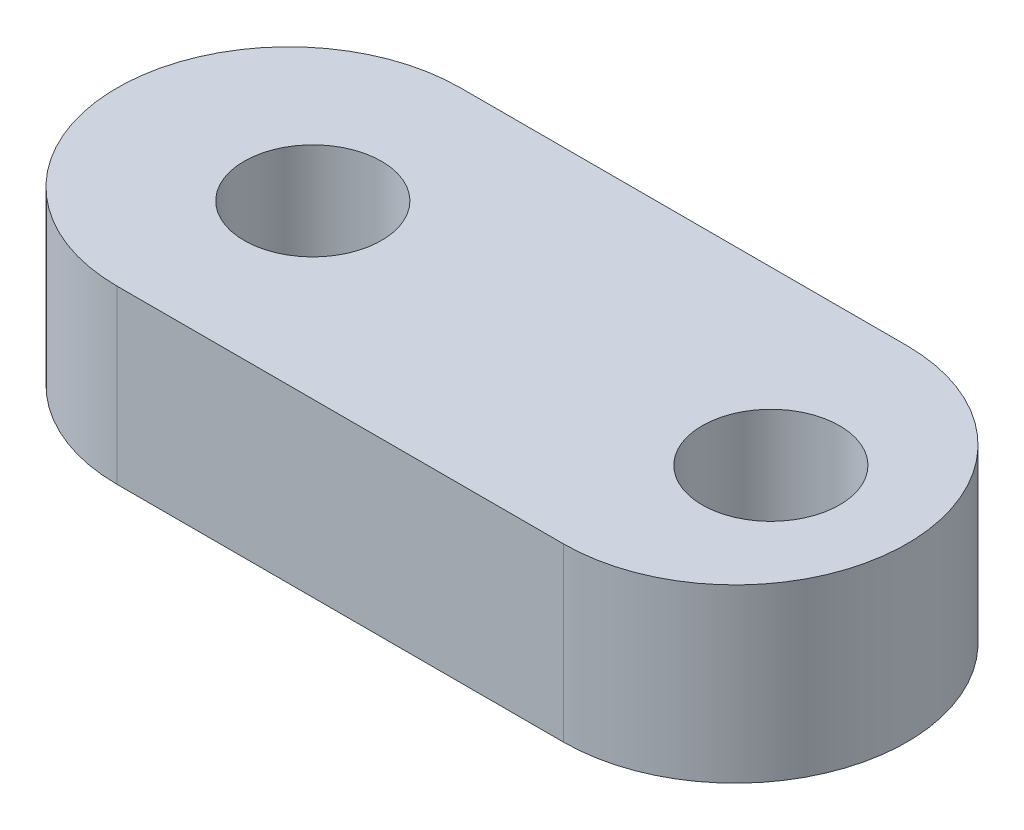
ISO-10303-21;
HEADER;
FILE_DESCRIPTION(('STEP AP214'),'2;1');
FILE_NAME('part.step','',(''),(''),'','','');
FILE_SCHEMA(('AUTOMOTIVE_DESIGN { 1 0 10303 214 1 1 1 1 }'));
ENDSEC;
DATA;
#1=APPLICATION_CONTEXT('core data for automotive mechanical design processes');
#2=APPLICATION_PROTOCOL_DEFINITION('international standard','automotive_design',2000,#1);
#3=PRODUCT_CONTEXT('',#1,'mechanical');
#4=PRODUCT('Part','Part','',(#3));
#5=PRODUCT_RELATED_PRODUCT_CATEGORY('part','',(#4));
#6=PRODUCT_DEFINITION_FORMATION('','',#4);
#7=PRODUCT_DEFINITION_CONTEXT('part definition',#1,'design');
#8=PRODUCT_DEFINITION('design','',#6,#7);
#9=PRODUCT_DEFINITION_SHAPE('','',#8);
#10=(LENGTH_UNIT() NAMED_UNIT(*) SI_UNIT(.MILLI.,.METRE.));
#11=(NAMED_UNIT(*) PLANE_ANGLE_UNIT() SI_UNIT($,.RADIAN.));
#12=(NAMED_UNIT(*) SI_UNIT($,.STERADIAN.) SOLID_ANGLE_UNIT());
#13=UNCERTAINTY_MEASURE_WITH_UNIT(LENGTH_MEASURE(1.E-05),#10,'distance_accuracy_value','');
#14=(GEOMETRIC_REPRESENTATION_CONTEXT(3) GLOBAL_UNCERTAINTY_ASSIGNED_CONTEXT((#13)) GLOBAL_UNIT_ASSIGNED_CONTEXT((#10,
#11,#12)) REPRESENTATION_CONTEXT('',''));
#15=CARTESIAN_POINT('',(0.,0.,0.));
#16=DIRECTION('',(0.,0.,1.));
#17=DIRECTION('',(1.,0.,0.));
#18=AXIS2_PLACEMENT_3D('',#15,#16,#17);
#19=CARTESIAN_POINT('',(17.3,0.,-5.));
#20=DIRECTION('',(0.,0.,1.));
#21=DIRECTION('',(-1.,0.,0.));
#22=AXIS2_PLACEMENT_3D('',#19,#20,#21);
#23=PLANE('',#22);
#24=DIRECTION('',(-1.,0.,0.));
#25=VECTOR('',#24,1.);
#26=CARTESIAN_POINT('',(17.3,-2.49999999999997,-5.));
#27=LINE('',#26,#25);
#28=CARTESIAN_POINT('',(12.3,-2.49999999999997,-5.));
#29=VERTEX_POINT('',#28);
#30=CARTESIAN_POINT('',(-0.700000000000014,-2.49999999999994,-5.));
#31=VERTEX_POINT('',#30);
#32=EDGE_CURVE('E115',#29,#31,#27,.T.);
#33=ORIENTED_EDGE('',*,*,#32,.T.);
#34=DIRECTION('',(0.,1.,0.));
#35=VECTOR('',#34,1.);
#36=CARTESIAN_POINT('',(-0.700000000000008,0.,-5.));
#37=LINE('',#36,#35);
#38=CARTESIAN_POINT('',(-0.70000000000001,2.5,-5.));
#39=VERTEX_POINT('',#38);
#40=EDGE_CURVE('E91',#31,#39,#37,.T.);
#41=ORIENTED_EDGE('',*,*,#40,.T.);
#42=DIRECTION('',(-1.,0.,0.));
#43=VECTOR('',#42,1.);
#44=CARTESIAN_POINT('',(17.3,2.5,-5.));
#45=LINE('',#44,#43);
#46=CARTESIAN_POINT('',(12.3,2.5,-5.));
#47=VERTEX_POINT('',#46);
#48=EDGE_CURVE('E76',#47,#39,#45,.T.);
#49=ORIENTED_EDGE('',*,*,#48,.F.);
#50=DIRECTION('',(0.,-1.,0.));
#51=VECTOR('',#50,1.);
#52=CARTESIAN_POINT('',(12.3,0.,-5.));
#53=LINE('',#52,#51);
#54=EDGE_CURVE('E85',#47,#29,#53,.T.);
#55=ORIENTED_EDGE('',*,*,#54,.T.);
#56=EDGE_LOOP('',(#33,#41,#49,#55));
#57=FACE_BOUND('',#56,.T.);
#58=ADVANCED_FACE('F17',(#57),#23,.F.);
#59=CARTESIAN_POINT('',(-0.7,0.,0.));
#60=DIRECTION('',(0.,-1.,0.));
#61=DIRECTION('',(1.,0.,0.));
#62=AXIS2_PLACEMENT_3D('',#59,#60,#61);
#63=CYLINDRICAL_SURFACE('',#62,5.);
#64=DIRECTION('',(0.,-1.,0.));
#65=VECTOR('',#64,1.);
#66=CARTESIAN_POINT('',(-0.7,0.,5.));
#67=LINE('',#66,#65);
#68=CARTESIAN_POINT('',(-0.7,2.5,5.));
#69=VERTEX_POINT('',#68);
#70=CARTESIAN_POINT('',(-0.7,-2.5,5.));
#71=VERTEX_POINT('',#70);
#72=EDGE_CURVE('E123',#69,#71,#67,.T.);
#73=ORIENTED_EDGE('',*,*,#72,.F.);
#74=CARTESIAN_POINT('',(-0.7,2.50000000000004,0.));
#75=DIRECTION('',(0.,1.,0.));
#76=DIRECTION('',(1.,0.,0.));
#77=AXIS2_PLACEMENT_3D('',#74,#75,#76);
#78=CIRCLE('',#77,5.);
#79=EDGE_CURVE('E95',#39,#69,#78,.T.);
#80=ORIENTED_EDGE('',*,*,#79,.F.);
#81=ORIENTED_EDGE('',*,*,#40,.F.);
#82=CARTESIAN_POINT('',(-0.700000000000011,-2.49999999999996,0.));
#83=DIRECTION('',(0.,-1.,0.));
#84=DIRECTION('',(1.,0.,0.));
#85=AXIS2_PLACEMENT_3D('',#82,#83,#84);
#86=CIRCLE('',#85,5.);
#87=EDGE_CURVE('E43',#71,#31,#86,.T.);
#88=ORIENTED_EDGE('',*,*,#87,.F.);
#89=EDGE_LOOP('',(#73,#80,#81,#88));
#90=FACE_BOUND('',#89,.T.);
#91=ADVANCED_FACE('F140',(#90),#63,.T.);
#92=CARTESIAN_POINT('',(12.3,0.,0.));
#93=DIRECTION('',(0.,-1.,0.));
#94=DIRECTION('',(1.,0.,0.));
#95=AXIS2_PLACEMENT_3D('',#92,#93,#94);
#96=CYLINDRICAL_SURFACE('',#95,5.);
#97=DIRECTION('',(0.,1.,0.));
#98=VECTOR('',#97,1.);
#99=CARTESIAN_POINT('',(12.3,0.,5.));
#100=LINE('',#99,#98);
#101=CARTESIAN_POINT('',(12.3,-2.49999999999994,5.));
#102=VERTEX_POINT('',#101);
#103=CARTESIAN_POINT('',(12.3,2.5,5.));
#104=VERTEX_POINT('',#103);
#105=EDGE_CURVE('E120',#102,#104,#100,.T.);
#106=ORIENTED_EDGE('',*,*,#105,.F.);
#107=CARTESIAN_POINT('',(12.3,-2.5,0.));
#108=DIRECTION('',(0.,-1.,0.));
#109=DIRECTION('',(1.,0.,0.));
#110=AXIS2_PLACEMENT_3D('',#107,#108,#109);
#111=CIRCLE('',#110,5.);
#112=EDGE_CURVE('E87',#29,#102,#111,.T.);
#113=ORIENTED_EDGE('',*,*,#112,.F.);
#114=ORIENTED_EDGE('',*,*,#54,.F.);
#115=CARTESIAN_POINT('',(12.3,2.5,0.));
#116=DIRECTION('',(0.,1.,0.));
#117=DIRECTION('',(1.,0.,0.));
#118=AXIS2_PLACEMENT_3D('',#115,#116,#117);
#119=CIRCLE('',#118,5.);
#120=EDGE_CURVE('E21',#104,#47,#119,.T.);
#121=ORIENTED_EDGE('',*,*,#120,.F.);
#122=EDGE_LOOP('',(#106,#113,#114,#121));
#123=FACE_BOUND('',#122,.T.);
#124=ADVANCED_FACE('F86',(#123),#96,.T.);
#125=CARTESIAN_POINT('',(17.3,-2.49999999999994,5.));
#126=DIRECTION('',(0.,-1.,0.));
#127=DIRECTION('',(0.,0.,-1.));
#128=AXIS2_PLACEMENT_3D('',#125,#126,#127);
#129=PLANE('',#128);
#130=ORIENTED_EDGE('',*,*,#32,.F.);
#131=ORIENTED_EDGE('',*,*,#112,.T.);
#132=DIRECTION('',(1.,0.,0.));
#133=VECTOR('',#132,1.);
#134=CARTESIAN_POINT('',(17.3,-2.49999999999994,5.));
#135=LINE('',#134,#133);
#136=EDGE_CURVE('E92',#71,#102,#135,.T.);
#137=ORIENTED_EDGE('',*,*,#136,.F.);
#138=ORIENTED_EDGE('',*,*,#87,.T.);
#139=EDGE_LOOP('',(#130,#131,#137,#138));
#140=FACE_BOUND('',#139,.T.);
#141=CARTESIAN_POINT('',(13.338,-2.5,0.));
#142=DIRECTION('',(0.,-1.,0.));
#143=DIRECTION('',(1.,0.,0.));
#144=AXIS2_PLACEMENT_3D('',#141,#142,#143);
#145=CIRCLE('',#144,2.);
#146=CARTESIAN_POINT('',(15.338,-2.5,0.));
#147=VERTEX_POINT('',#146);
#148=EDGE_CURVE('E11',#147,#147,#145,.T.);
#149=ORIENTED_EDGE('',*,*,#148,.F.);
#150=EDGE_LOOP('',(#149));
#151=FACE_BOUND('',#150,.T.);
#152=CARTESIAN_POINT('',(0.,-2.49999999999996,0.));
#153=DIRECTION('',(0.,-1.,0.));
#154=DIRECTION('',(1.,0.,0.));
#155=AXIS2_PLACEMENT_3D('',#152,#153,#154);
#156=CIRCLE('',#155,2.);
#157=CARTESIAN_POINT('',(2.,-2.49999999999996,0.));
#158=VERTEX_POINT('',#157);
#159=EDGE_CURVE('E28',#158,#158,#156,.T.);
#160=ORIENTED_EDGE('',*,*,#159,.F.);
#161=EDGE_LOOP('',(#160));
#162=FACE_BOUND('',#161,.T.);
#163=ADVANCED_FACE('F138',(#140,#151,#162),#129,.T.);
#164=CARTESIAN_POINT('',(0.,0.,0.));
#165=DIRECTION('',(0.,1.,0.));
#166=DIRECTION('',(-1.,0.,0.));
#167=AXIS2_PLACEMENT_3D('',#164,#165,#166);
#168=CYLINDRICAL_SURFACE('',#167,2.);
#169=CARTESIAN_POINT('',(0.,2.50000000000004,0.));
#170=DIRECTION('',(0.,1.,0.));
#171=DIRECTION('',(-1.,0.,0.));
#172=AXIS2_PLACEMENT_3D('',#169,#170,#171);
#173=CIRCLE('',#172,2.);
#174=CARTESIAN_POINT('',(-2.,2.50000000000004,0.));
#175=VERTEX_POINT('',#174);
#176=EDGE_CURVE('E83',#175,#175,#173,.T.);
#177=ORIENTED_EDGE('',*,*,#176,.T.);
#178=EDGE_LOOP('',(#177));
#179=FACE_BOUND('',#178,.T.);
#180=ORIENTED_EDGE('',*,*,#159,.T.);
#181=EDGE_LOOP('',(#180));
#182=FACE_BOUND('',#181,.T.);
#183=ADVANCED_FACE('F158',(#179,#182),#168,.F.);
#184=CARTESIAN_POINT('',(13.338,0.,0.));
#185=DIRECTION('',(0.,1.,0.));
#186=DIRECTION('',(-1.,0.,0.));
#187=AXIS2_PLACEMENT_3D('',#184,#185,#186);
#188=CYLINDRICAL_SURFACE('',#187,2.);
#189=CARTESIAN_POINT('',(13.338,2.5,0.));
#190=DIRECTION('',(0.,1.,0.));
#191=DIRECTION('',(-1.,0.,0.));
#192=AXIS2_PLACEMENT_3D('',#189,#190,#191);
#193=CIRCLE('',#192,2.);
#194=CARTESIAN_POINT('',(11.338,2.5,0.));
#195=VERTEX_POINT('',#194);
#196=EDGE_CURVE('E105',#195,#195,#193,.T.);
#197=ORIENTED_EDGE('',*,*,#196,.T.);
#198=EDGE_LOOP('',(#197));
#199=FACE_BOUND('',#198,.T.);
#200=ORIENTED_EDGE('',*,*,#148,.T.);
#201=EDGE_LOOP('',(#200));
#202=FACE_BOUND('',#201,.T.);
#203=ADVANCED_FACE('F152',(#199,#202),#188,.F.);
#204=CARTESIAN_POINT('',(17.3,0.,5.));
#205=DIRECTION('',(0.,0.,-1.));
#206=DIRECTION('',(0.,-1.,0.));
#207=AXIS2_PLACEMENT_3D('',#204,#205,#206);
#208=PLANE('',#207);
#209=ORIENTED_EDGE('',*,*,#136,.T.);
#210=ORIENTED_EDGE('',*,*,#105,.T.);
#211=DIRECTION('',(1.,0.,0.));
#212=VECTOR('',#211,1.);
#213=CARTESIAN_POINT('',(17.3,2.5,5.));
#214=LINE('',#213,#212);
#215=EDGE_CURVE('E79',#69,#104,#214,.T.);
#216=ORIENTED_EDGE('',*,*,#215,.F.);
#217=ORIENTED_EDGE('',*,*,#72,.T.);
#218=EDGE_LOOP('',(#209,#210,#216,#217));
#219=FACE_BOUND('',#218,.T.);
#220=ADVANCED_FACE('F136',(#219),#208,.F.);
#221=CARTESIAN_POINT('',(17.3,2.5,5.));
#222=DIRECTION('',(0.,-1.,0.));
#223=DIRECTION('',(0.,0.,-1.));
#224=AXIS2_PLACEMENT_3D('',#221,#222,#223);
#225=PLANE('',#224);
#226=ORIENTED_EDGE('',*,*,#120,.T.);
#227=ORIENTED_EDGE('',*,*,#48,.T.);
#228=ORIENTED_EDGE('',*,*,#79,.T.);
#229=ORIENTED_EDGE('',*,*,#215,.T.);
#230=EDGE_LOOP('',(#226,#227,#228,#229));
#231=FACE_BOUND('',#230,.T.);
#232=ORIENTED_EDGE('',*,*,#196,.F.);
#233=EDGE_LOOP('',(#232));
#234=FACE_BOUND('',#233,.T.);
#235=ORIENTED_EDGE('',*,*,#176,.F.);
#236=EDGE_LOOP('',(#235));
#237=FACE_BOUND('',#236,.T.);
#238=ADVANCED_FACE('F19',(#231,#234,#237),#225,.F.);
#239=CLOSED_SHELL('',(#58,#91,#124,#163,#183,#203,#220,#238));
#240=MANIFOLD_SOLID_BREP('B1',#239);
#241=ADVANCED_BREP_SHAPE_REPRESENTATION('',(#18,#240),#14);
#242=SHAPE_DEFINITION_REPRESENTATION(#9,#241);
ENDSEC;
END-ISO-10303-21;
